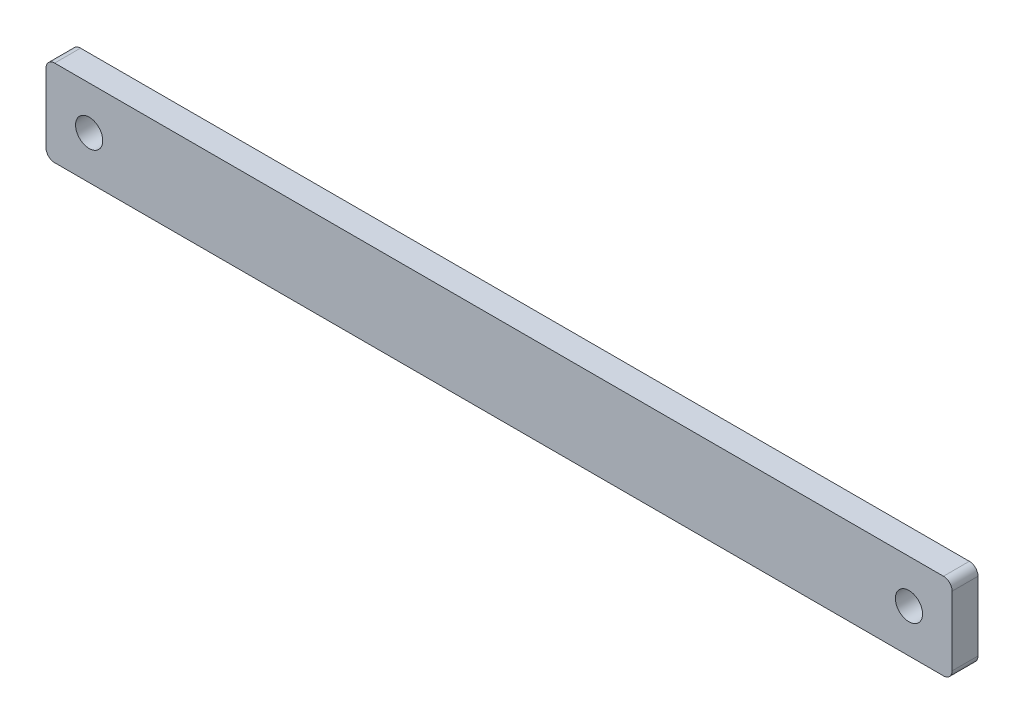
from build123d import *

# Parameters (mm, degrees)
SKETCH1_W           = 266.7
SKETCH1_H           = 25.4
BOSS_EXTRUDE1_DEPTH = 7.62
SKETCH2_R           = 4
CUT_EXTRUDE1_DEPTH  = 269.015138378
FILLET1_R           = 2.54


with BuildPart() as part:
    # Sketch1 → Boss-Extrude1 (new body)
    with BuildSketch(Plane.XY):
        with Locations((133.35, 12.7)):
            Rectangle(SKETCH1_W, SKETCH1_H)
    extrude(amount=BOSS_EXTRUDE1_DEPTH)

    # Sketch2 → Cut-Extrude1 (cut, through all)
    with BuildSketch(Plane.XY.offset(7.62)):
        with Locations((12.7, 12.7)):
            Circle(SKETCH2_R)
    cut_extrude1 = extrude(amount=-CUT_EXTRUDE1_DEPTH, mode=Mode.SUBTRACT)

    # Mirror1: Cut-Extrude1 across plane
    add(cut_extrude1.mirror(Plane(origin=(133.35, 0, 0), x_dir=(0, 0, 1), z_dir=(1, 0, 0))), mode=Mode.SUBTRACT)

    # Fillet1
    fillet1_edges = [part.edges().sort_by_distance(p)[0] for p in [
        (0, 25.4, 3.81),
        (266.7, 25.4, 3.81),
        (266.7, 0, 3.81),
        (0, 0, 3.81),
    ]]
    fillet(fillet1_edges, radius=FILLET1_R)


solid = part.part
